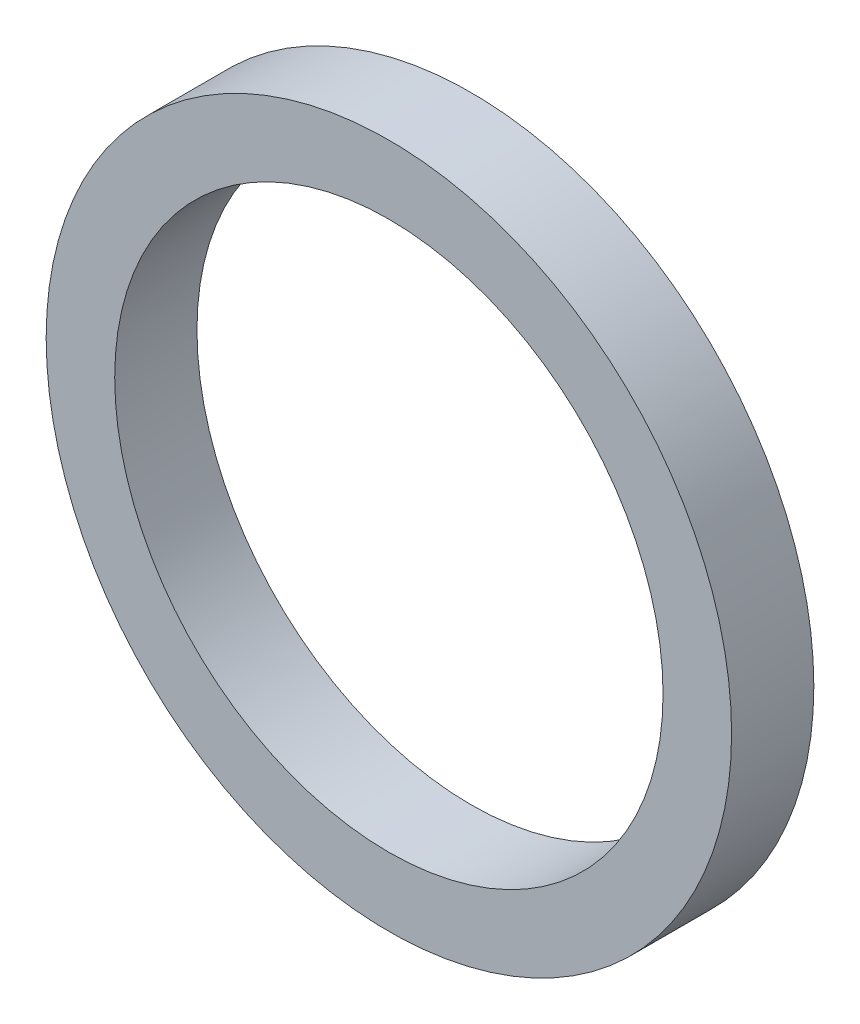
ISO-10303-21;
HEADER;
FILE_DESCRIPTION(('STEP AP214'),'2;1');
FILE_NAME('part.step','',(''),(''),'','','');
FILE_SCHEMA(('AUTOMOTIVE_DESIGN { 1 0 10303 214 1 1 1 1 }'));
ENDSEC;
DATA;
#1=APPLICATION_CONTEXT('core data for automotive mechanical design processes');
#2=APPLICATION_PROTOCOL_DEFINITION('international standard','automotive_design',2000,#1);
#3=PRODUCT_CONTEXT('',#1,'mechanical');
#4=PRODUCT('Part','Part','',(#3));
#5=PRODUCT_RELATED_PRODUCT_CATEGORY('part','',(#4));
#6=PRODUCT_DEFINITION_FORMATION('','',#4);
#7=PRODUCT_DEFINITION_CONTEXT('part definition',#1,'design');
#8=PRODUCT_DEFINITION('design','',#6,#7);
#9=PRODUCT_DEFINITION_SHAPE('','',#8);
#10=(LENGTH_UNIT() NAMED_UNIT(*) SI_UNIT(.MILLI.,.METRE.));
#11=(NAMED_UNIT(*) PLANE_ANGLE_UNIT() SI_UNIT($,.RADIAN.));
#12=(NAMED_UNIT(*) SI_UNIT($,.STERADIAN.) SOLID_ANGLE_UNIT());
#13=UNCERTAINTY_MEASURE_WITH_UNIT(LENGTH_MEASURE(1.E-05),#10,'distance_accuracy_value','');
#14=(GEOMETRIC_REPRESENTATION_CONTEXT(3) GLOBAL_UNCERTAINTY_ASSIGNED_CONTEXT((#13)) GLOBAL_UNIT_ASSIGNED_CONTEXT((#10,
#11,#12)) REPRESENTATION_CONTEXT('',''));
#15=CARTESIAN_POINT('',(0.,0.,0.));
#16=DIRECTION('',(0.,0.,1.));
#17=DIRECTION('',(1.,0.,0.));
#18=AXIS2_PLACEMENT_3D('',#15,#16,#17);
#19=CARTESIAN_POINT('',(0.,0.,3.));
#20=DIRECTION('',(0.,0.,1.));
#21=DIRECTION('',(1.,0.,0.));
#22=AXIS2_PLACEMENT_3D('',#19,#20,#21);
#23=PLANE('',#22);
#24=CARTESIAN_POINT('',(0.,0.,3.));
#25=DIRECTION('',(0.,0.,1.));
#26=DIRECTION('',(1.,0.,0.));
#27=AXIS2_PLACEMENT_3D('',#24,#25,#26);
#28=CIRCLE('',#27,12.5);
#29=CARTESIAN_POINT('',(12.5,0.,3.));
#30=VERTEX_POINT('',#29);
#31=EDGE_CURVE('E10',#30,#30,#28,.T.);
#32=ORIENTED_EDGE('',*,*,#31,.T.);
#33=EDGE_LOOP('',(#32));
#34=FACE_BOUND('',#33,.T.);
#35=CARTESIAN_POINT('',(0.,0.,3.));
#36=DIRECTION('',(0.,0.,1.));
#37=DIRECTION('',(1.,0.,0.));
#38=AXIS2_PLACEMENT_3D('',#35,#36,#37);
#39=CIRCLE('',#38,10.);
#40=CARTESIAN_POINT('',(10.,0.,3.));
#41=VERTEX_POINT('',#40);
#42=EDGE_CURVE('E40',#41,#41,#39,.T.);
#43=ORIENTED_EDGE('',*,*,#42,.F.);
#44=EDGE_LOOP('',(#43));
#45=FACE_BOUND('',#44,.T.);
#46=ADVANCED_FACE('F29',(#34,#45),#23,.T.);
#47=CARTESIAN_POINT('',(0.,0.,0.));
#48=DIRECTION('',(0.,0.,1.));
#49=DIRECTION('',(1.,0.,0.));
#50=AXIS2_PLACEMENT_3D('',#47,#48,#49);
#51=PLANE('',#50);
#52=CARTESIAN_POINT('',(0.,0.,0.));
#53=DIRECTION('',(0.,0.,1.));
#54=DIRECTION('',(1.,0.,0.));
#55=AXIS2_PLACEMENT_3D('',#52,#53,#54);
#56=CIRCLE('',#55,12.5);
#57=CARTESIAN_POINT('',(12.5,0.,0.));
#58=VERTEX_POINT('',#57);
#59=EDGE_CURVE('E33',#58,#58,#56,.T.);
#60=ORIENTED_EDGE('',*,*,#59,.F.);
#61=EDGE_LOOP('',(#60));
#62=FACE_BOUND('',#61,.T.);
#63=CARTESIAN_POINT('',(0.,0.,0.));
#64=DIRECTION('',(0.,0.,1.));
#65=DIRECTION('',(1.,0.,0.));
#66=AXIS2_PLACEMENT_3D('',#63,#64,#65);
#67=CIRCLE('',#66,10.);
#68=CARTESIAN_POINT('',(10.,0.,0.));
#69=VERTEX_POINT('',#68);
#70=EDGE_CURVE('E42',#69,#69,#67,.T.);
#71=ORIENTED_EDGE('',*,*,#70,.T.);
#72=EDGE_LOOP('',(#71));
#73=FACE_BOUND('',#72,.T.);
#74=ADVANCED_FACE('F52',(#62,#73),#51,.F.);
#75=CARTESIAN_POINT('',(0.,0.,3.));
#76=DIRECTION('',(0.,0.,-1.));
#77=DIRECTION('',(-1.,0.,0.));
#78=AXIS2_PLACEMENT_3D('',#75,#76,#77);
#79=CYLINDRICAL_SURFACE('',#78,12.5);
#80=ORIENTED_EDGE('',*,*,#31,.F.);
#81=EDGE_LOOP('',(#80));
#82=FACE_BOUND('',#81,.T.);
#83=ORIENTED_EDGE('',*,*,#59,.T.);
#84=EDGE_LOOP('',(#83));
#85=FACE_BOUND('',#84,.T.);
#86=ADVANCED_FACE('F31',(#82,#85),#79,.T.);
#87=CARTESIAN_POINT('',(0.,0.,3.));
#88=DIRECTION('',(0.,0.,-1.));
#89=DIRECTION('',(-1.,0.,0.));
#90=AXIS2_PLACEMENT_3D('',#87,#88,#89);
#91=CYLINDRICAL_SURFACE('',#90,10.);
#92=ORIENTED_EDGE('',*,*,#42,.T.);
#93=EDGE_LOOP('',(#92));
#94=FACE_BOUND('',#93,.T.);
#95=ORIENTED_EDGE('',*,*,#70,.F.);
#96=EDGE_LOOP('',(#95));
#97=FACE_BOUND('',#96,.T.);
#98=ADVANCED_FACE('F48',(#94,#97),#91,.F.);
#99=CLOSED_SHELL('',(#46,#74,#86,#98));
#100=MANIFOLD_SOLID_BREP('B2',#99);
#101=ADVANCED_BREP_SHAPE_REPRESENTATION('',(#18,#100),#14);
#102=SHAPE_DEFINITION_REPRESENTATION(#9,#101);
ENDSEC;
END-ISO-10303-21;
